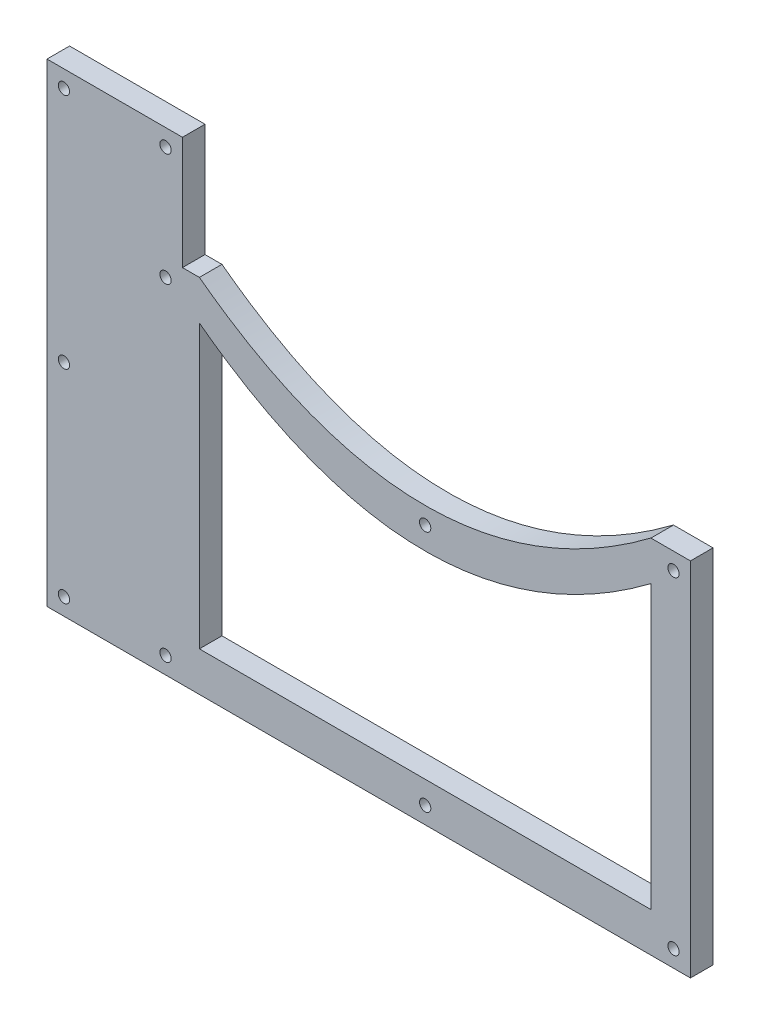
ISO-10303-21;
HEADER;
FILE_DESCRIPTION(('STEP AP214'),'2;1');
FILE_NAME('part.step','',(''),(''),'','','');
FILE_SCHEMA(('AUTOMOTIVE_DESIGN { 1 0 10303 214 1 1 1 1 }'));
ENDSEC;
DATA;
#1=APPLICATION_CONTEXT('core data for automotive mechanical design processes');
#2=APPLICATION_PROTOCOL_DEFINITION('international standard','automotive_design',2000,#1);
#3=PRODUCT_CONTEXT('',#1,'mechanical');
#4=PRODUCT('Part','Part','',(#3));
#5=PRODUCT_RELATED_PRODUCT_CATEGORY('part','',(#4));
#6=PRODUCT_DEFINITION_FORMATION('','',#4);
#7=PRODUCT_DEFINITION_CONTEXT('part definition',#1,'design');
#8=PRODUCT_DEFINITION('design','',#6,#7);
#9=PRODUCT_DEFINITION_SHAPE('','',#8);
#10=(LENGTH_UNIT() NAMED_UNIT(*) SI_UNIT(.MILLI.,.METRE.));
#11=(NAMED_UNIT(*) PLANE_ANGLE_UNIT() SI_UNIT($,.RADIAN.));
#12=(NAMED_UNIT(*) SI_UNIT($,.STERADIAN.) SOLID_ANGLE_UNIT());
#13=UNCERTAINTY_MEASURE_WITH_UNIT(LENGTH_MEASURE(1.E-05),#10,'distance_accuracy_value','');
#14=(GEOMETRIC_REPRESENTATION_CONTEXT(3) GLOBAL_UNCERTAINTY_ASSIGNED_CONTEXT((#13)) GLOBAL_UNIT_ASSIGNED_CONTEXT((#10,
#11,#12)) REPRESENTATION_CONTEXT('',''));
#15=CARTESIAN_POINT('',(0.,0.,0.));
#16=DIRECTION('',(0.,0.,1.));
#17=DIRECTION('',(1.,0.,0.));
#18=AXIS2_PLACEMENT_3D('',#15,#16,#17);
#19=CARTESIAN_POINT('',(67.,49.,4.));
#20=DIRECTION('',(0.,0.,-1.));
#21=DIRECTION('',(-1.,0.,0.));
#22=AXIS2_PLACEMENT_3D('',#19,#20,#21);
#23=PLANE('',#22);
#24=CARTESIAN_POINT('',(107.,64.,4.));
#25=CARTESIAN_POINT('',(67.,34.,4.));
#26=CARTESIAN_POINT('',(27.,64.,4.));
#27=B_SPLINE_CURVE_WITH_KNOTS('',2,(#24,#25,#26),.UNSPECIFIED.,.F.,.F.,(3,3),(0.,1.),.UNSPECIFIED.);
#28=CARTESIAN_POINT('',(107.,64.,4.));
#29=VERTEX_POINT('',#28);
#30=CARTESIAN_POINT('',(27.,64.,4.));
#31=VERTEX_POINT('',#30);
#32=EDGE_CURVE('E256',#29,#31,#27,.T.);
#33=ORIENTED_EDGE('',*,*,#32,.T.);
#34=DIRECTION('',(-1.,0.,0.));
#35=VECTOR('',#34,1.);
#36=CARTESIAN_POINT('',(24.,64.,4.));
#37=LINE('',#36,#35);
#38=CARTESIAN_POINT('',(24.,64.,4.));
#39=VERTEX_POINT('',#38);
#40=EDGE_CURVE('E290',#31,#39,#37,.T.);
#41=ORIENTED_EDGE('',*,*,#40,.T.);
#42=DIRECTION('',(0.,1.,0.));
#43=VECTOR('',#42,1.);
#44=CARTESIAN_POINT('',(24.,64.,4.));
#45=LINE('',#44,#43);
#46=CARTESIAN_POINT('',(24.,84.,4.));
#47=VERTEX_POINT('',#46);
#48=EDGE_CURVE('E231',#39,#47,#45,.T.);
#49=ORIENTED_EDGE('',*,*,#48,.T.);
#50=DIRECTION('',(-1.,0.,0.));
#51=VECTOR('',#50,1.);
#52=CARTESIAN_POINT('',(24.,84.,4.));
#53=LINE('',#52,#51);
#54=CARTESIAN_POINT('',(0.,84.,4.));
#55=VERTEX_POINT('',#54);
#56=EDGE_CURVE('E281',#47,#55,#53,.T.);
#57=ORIENTED_EDGE('',*,*,#56,.T.);
#58=DIRECTION('',(0.,-1.,0.));
#59=VECTOR('',#58,1.);
#60=CARTESIAN_POINT('',(0.,84.,4.));
#61=LINE('',#60,#59);
#62=CARTESIAN_POINT('',(0.,0.,4.));
#63=VERTEX_POINT('',#62);
#64=EDGE_CURVE('E284',#55,#63,#61,.T.);
#65=ORIENTED_EDGE('',*,*,#64,.T.);
#66=DIRECTION('',(1.,0.,0.));
#67=VECTOR('',#66,1.);
#68=CARTESIAN_POINT('',(0.,0.,4.));
#69=LINE('',#68,#67);
#70=CARTESIAN_POINT('',(114.,0.,4.));
#71=VERTEX_POINT('',#70);
#72=EDGE_CURVE('E288',#63,#71,#69,.T.);
#73=ORIENTED_EDGE('',*,*,#72,.T.);
#74=DIRECTION('',(0.,1.,0.));
#75=VECTOR('',#74,1.);
#76=CARTESIAN_POINT('',(114.,0.,4.));
#77=LINE('',#76,#75);
#78=CARTESIAN_POINT('',(114.,64.,4.));
#79=VERTEX_POINT('',#78);
#80=EDGE_CURVE('E296',#71,#79,#77,.T.);
#81=ORIENTED_EDGE('',*,*,#80,.T.);
#82=DIRECTION('',(-1.,0.,0.));
#83=VECTOR('',#82,1.);
#84=CARTESIAN_POINT('',(114.,64.,4.));
#85=LINE('',#84,#83);
#86=EDGE_CURVE('E262',#79,#29,#85,.T.);
#87=ORIENTED_EDGE('',*,*,#86,.T.);
#88=EDGE_LOOP('',(#33,#41,#49,#57,#65,#73,#81,#87));
#89=FACE_BOUND('',#88,.T.);
#90=DIRECTION('',(1.,0.,0.));
#91=VECTOR('',#90,1.);
#92=CARTESIAN_POINT('',(27.,6.99999999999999,4.));
#93=LINE('',#92,#91);
#94=CARTESIAN_POINT('',(27.,6.99999999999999,4.));
#95=VERTEX_POINT('',#94);
#96=CARTESIAN_POINT('',(107.,7.,4.));
#97=VERTEX_POINT('',#96);
#98=EDGE_CURVE('E130',#95,#97,#93,.T.);
#99=ORIENTED_EDGE('',*,*,#98,.F.);
#100=DIRECTION('',(0.,-1.,0.));
#101=VECTOR('',#100,1.);
#102=CARTESIAN_POINT('',(27.,57.,4.));
#103=LINE('',#102,#101);
#104=CARTESIAN_POINT('',(27.,57.,4.));
#105=VERTEX_POINT('',#104);
#106=EDGE_CURVE('E157',#105,#95,#103,.T.);
#107=ORIENTED_EDGE('',*,*,#106,.F.);
#108=CARTESIAN_POINT('',(107.,57.,4.));
#109=CARTESIAN_POINT('',(67.,27.,4.));
#110=CARTESIAN_POINT('',(27.,57.,4.));
#111=B_SPLINE_CURVE_WITH_KNOTS('',2,(#108,#109,#110),.UNSPECIFIED.,.F.,.F.,(3,3),(0.,1.),.UNSPECIFIED.);
#112=CARTESIAN_POINT('',(107.,57.,4.));
#113=VERTEX_POINT('',#112);
#114=EDGE_CURVE('E153',#113,#105,#111,.T.);
#115=ORIENTED_EDGE('',*,*,#114,.F.);
#116=DIRECTION('',(0.,1.,0.));
#117=VECTOR('',#116,1.);
#118=CARTESIAN_POINT('',(107.,7.,4.));
#119=LINE('',#118,#117);
#120=EDGE_CURVE('E139',#97,#113,#119,.T.);
#121=ORIENTED_EDGE('',*,*,#120,.F.);
#122=EDGE_LOOP('',(#99,#107,#115,#121));
#123=FACE_BOUND('',#122,.T.);
#124=CARTESIAN_POINT('',(3.,81.,4.));
#125=DIRECTION('',(0.,0.,1.));
#126=DIRECTION('',(1.,0.,0.));
#127=AXIS2_PLACEMENT_3D('',#124,#125,#126);
#128=CIRCLE('',#127,1.);
#129=CARTESIAN_POINT('',(4.,81.,4.));
#130=VERTEX_POINT('',#129);
#131=EDGE_CURVE('E347',#130,#130,#128,.T.);
#132=ORIENTED_EDGE('',*,*,#131,.F.);
#133=EDGE_LOOP('',(#132));
#134=FACE_BOUND('',#133,.T.);
#135=CARTESIAN_POINT('',(21.,81.,4.));
#136=DIRECTION('',(0.,0.,1.));
#137=DIRECTION('',(1.,0.,0.));
#138=AXIS2_PLACEMENT_3D('',#135,#136,#137);
#139=CIRCLE('',#138,1.);
#140=CARTESIAN_POINT('',(22.,81.,4.));
#141=VERTEX_POINT('',#140);
#142=EDGE_CURVE('E356',#141,#141,#139,.T.);
#143=ORIENTED_EDGE('',*,*,#142,.F.);
#144=EDGE_LOOP('',(#143));
#145=FACE_BOUND('',#144,.T.);
#146=CARTESIAN_POINT('',(21.,61.,4.));
#147=DIRECTION('',(0.,0.,1.));
#148=DIRECTION('',(1.,0.,0.));
#149=AXIS2_PLACEMENT_3D('',#146,#147,#148);
#150=CIRCLE('',#149,1.);
#151=CARTESIAN_POINT('',(22.,61.,4.));
#152=VERTEX_POINT('',#151);
#153=EDGE_CURVE('E362',#152,#152,#150,.T.);
#154=ORIENTED_EDGE('',*,*,#153,.F.);
#155=EDGE_LOOP('',(#154));
#156=FACE_BOUND('',#155,.T.);
#157=CARTESIAN_POINT('',(3.00000000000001,39.,4.));
#158=DIRECTION('',(0.,0.,1.));
#159=DIRECTION('',(1.,0.,0.));
#160=AXIS2_PLACEMENT_3D('',#157,#158,#159);
#161=CIRCLE('',#160,1.);
#162=CARTESIAN_POINT('',(4.00000000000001,39.,4.));
#163=VERTEX_POINT('',#162);
#164=EDGE_CURVE('E370',#163,#163,#161,.T.);
#165=ORIENTED_EDGE('',*,*,#164,.F.);
#166=EDGE_LOOP('',(#165));
#167=FACE_BOUND('',#166,.T.);
#168=CARTESIAN_POINT('',(3.00000000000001,3.,4.));
#169=DIRECTION('',(0.,0.,1.));
#170=DIRECTION('',(1.,0.,0.));
#171=AXIS2_PLACEMENT_3D('',#168,#169,#170);
#172=CIRCLE('',#171,1.);
#173=CARTESIAN_POINT('',(4.00000000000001,3.,4.));
#174=VERTEX_POINT('',#173);
#175=EDGE_CURVE('E378',#174,#174,#172,.T.);
#176=ORIENTED_EDGE('',*,*,#175,.F.);
#177=EDGE_LOOP('',(#176));
#178=FACE_BOUND('',#177,.T.);
#179=CARTESIAN_POINT('',(21.,3.,4.));
#180=DIRECTION('',(0.,0.,1.));
#181=DIRECTION('',(1.,0.,0.));
#182=AXIS2_PLACEMENT_3D('',#179,#180,#181);
#183=CIRCLE('',#182,1.);
#184=CARTESIAN_POINT('',(22.,3.,4.));
#185=VERTEX_POINT('',#184);
#186=EDGE_CURVE('E386',#185,#185,#183,.T.);
#187=ORIENTED_EDGE('',*,*,#186,.F.);
#188=EDGE_LOOP('',(#187));
#189=FACE_BOUND('',#188,.T.);
#190=CARTESIAN_POINT('',(67.,3.,4.));
#191=DIRECTION('',(0.,0.,1.));
#192=DIRECTION('',(1.,0.,0.));
#193=AXIS2_PLACEMENT_3D('',#190,#191,#192);
#194=CIRCLE('',#193,0.999999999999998);
#195=CARTESIAN_POINT('',(68.,3.,4.));
#196=VERTEX_POINT('',#195);
#197=EDGE_CURVE('E394',#196,#196,#194,.T.);
#198=ORIENTED_EDGE('',*,*,#197,.F.);
#199=EDGE_LOOP('',(#198));
#200=FACE_BOUND('',#199,.T.);
#201=CARTESIAN_POINT('',(111.,3.,4.));
#202=DIRECTION('',(0.,0.,1.));
#203=DIRECTION('',(1.,0.,0.));
#204=AXIS2_PLACEMENT_3D('',#201,#202,#203);
#205=CIRCLE('',#204,0.999999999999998);
#206=CARTESIAN_POINT('',(112.,3.,4.));
#207=VERTEX_POINT('',#206);
#208=EDGE_CURVE('E402',#207,#207,#205,.T.);
#209=ORIENTED_EDGE('',*,*,#208,.F.);
#210=EDGE_LOOP('',(#209));
#211=FACE_BOUND('',#210,.T.);
#212=CARTESIAN_POINT('',(111.,61.,4.));
#213=DIRECTION('',(0.,0.,1.));
#214=DIRECTION('',(1.,0.,0.));
#215=AXIS2_PLACEMENT_3D('',#212,#213,#214);
#216=CIRCLE('',#215,0.999999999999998);
#217=CARTESIAN_POINT('',(112.,61.,4.));
#218=VERTEX_POINT('',#217);
#219=EDGE_CURVE('E410',#218,#218,#216,.T.);
#220=ORIENTED_EDGE('',*,*,#219,.F.);
#221=EDGE_LOOP('',(#220));
#222=FACE_BOUND('',#221,.T.);
#223=CARTESIAN_POINT('',(67.,46.,4.));
#224=DIRECTION('',(0.,0.,1.));
#225=DIRECTION('',(1.,0.,0.));
#226=AXIS2_PLACEMENT_3D('',#223,#224,#225);
#227=CIRCLE('',#226,0.999999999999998);
#228=CARTESIAN_POINT('',(68.,46.,4.));
#229=VERTEX_POINT('',#228);
#230=EDGE_CURVE('E418',#229,#229,#227,.T.);
#231=ORIENTED_EDGE('',*,*,#230,.F.);
#232=EDGE_LOOP('',(#231));
#233=FACE_BOUND('',#232,.T.);
#234=ADVANCED_FACE('F39',(#89,#123,#134,#145,#156,#167,#178,#189,#200,#211,#222,#233),#23,.F.);
#235=CARTESIAN_POINT('',(67.,49.,0.));
#236=DIRECTION('',(0.,0.,-1.));
#237=DIRECTION('',(-1.,0.,0.));
#238=AXIS2_PLACEMENT_3D('',#235,#236,#237);
#239=PLANE('',#238);
#240=CARTESIAN_POINT('',(111.,61.,0.));
#241=DIRECTION('',(0.,0.,1.));
#242=DIRECTION('',(1.,0.,0.));
#243=AXIS2_PLACEMENT_3D('',#240,#241,#242);
#244=CIRCLE('',#243,0.999999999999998);
#245=CARTESIAN_POINT('',(112.,61.,0.));
#246=VERTEX_POINT('',#245);
#247=EDGE_CURVE('E414',#246,#246,#244,.T.);
#248=ORIENTED_EDGE('',*,*,#247,.T.);
#249=EDGE_LOOP('',(#248));
#250=FACE_BOUND('',#249,.T.);
#251=CARTESIAN_POINT('',(67.,3.,0.));
#252=DIRECTION('',(0.,0.,1.));
#253=DIRECTION('',(1.,0.,0.));
#254=AXIS2_PLACEMENT_3D('',#251,#252,#253);
#255=CIRCLE('',#254,0.999999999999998);
#256=CARTESIAN_POINT('',(68.,3.,0.));
#257=VERTEX_POINT('',#256);
#258=EDGE_CURVE('E398',#257,#257,#255,.T.);
#259=ORIENTED_EDGE('',*,*,#258,.T.);
#260=EDGE_LOOP('',(#259));
#261=FACE_BOUND('',#260,.T.);
#262=CARTESIAN_POINT('',(3.00000000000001,3.,0.));
#263=DIRECTION('',(0.,0.,1.));
#264=DIRECTION('',(1.,0.,0.));
#265=AXIS2_PLACEMENT_3D('',#262,#263,#264);
#266=CIRCLE('',#265,1.);
#267=CARTESIAN_POINT('',(4.00000000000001,3.,0.));
#268=VERTEX_POINT('',#267);
#269=EDGE_CURVE('E382',#268,#268,#266,.T.);
#270=ORIENTED_EDGE('',*,*,#269,.T.);
#271=EDGE_LOOP('',(#270));
#272=FACE_BOUND('',#271,.T.);
#273=CARTESIAN_POINT('',(21.,61.,0.));
#274=DIRECTION('',(0.,0.,1.));
#275=DIRECTION('',(1.,0.,0.));
#276=AXIS2_PLACEMENT_3D('',#273,#274,#275);
#277=CIRCLE('',#276,1.);
#278=CARTESIAN_POINT('',(22.,61.,0.));
#279=VERTEX_POINT('',#278);
#280=EDGE_CURVE('E366',#279,#279,#277,.T.);
#281=ORIENTED_EDGE('',*,*,#280,.T.);
#282=EDGE_LOOP('',(#281));
#283=FACE_BOUND('',#282,.T.);
#284=CARTESIAN_POINT('',(3.,81.,0.));
#285=DIRECTION('',(0.,0.,1.));
#286=DIRECTION('',(1.,0.,0.));
#287=AXIS2_PLACEMENT_3D('',#284,#285,#286);
#288=CIRCLE('',#287,1.);
#289=CARTESIAN_POINT('',(4.,81.,0.));
#290=VERTEX_POINT('',#289);
#291=EDGE_CURVE('E350',#290,#290,#288,.T.);
#292=ORIENTED_EDGE('',*,*,#291,.T.);
#293=EDGE_LOOP('',(#292));
#294=FACE_BOUND('',#293,.T.);
#295=CARTESIAN_POINT('',(107.,64.,0.));
#296=CARTESIAN_POINT('',(67.,34.,0.));
#297=CARTESIAN_POINT('',(27.,64.,0.));
#298=B_SPLINE_CURVE_WITH_KNOTS('',2,(#295,#296,#297),.UNSPECIFIED.,.F.,.F.,(3,3),(0.,1.),.UNSPECIFIED.);
#299=CARTESIAN_POINT('',(107.,64.,0.));
#300=VERTEX_POINT('',#299);
#301=CARTESIAN_POINT('',(27.,64.,0.));
#302=VERTEX_POINT('',#301);
#303=EDGE_CURVE('E148',#300,#302,#298,.T.);
#304=ORIENTED_EDGE('',*,*,#303,.F.);
#305=DIRECTION('',(-1.,0.,0.));
#306=VECTOR('',#305,1.);
#307=CARTESIAN_POINT('',(114.,64.,0.));
#308=LINE('',#307,#306);
#309=CARTESIAN_POINT('',(114.,64.,0.));
#310=VERTEX_POINT('',#309);
#311=EDGE_CURVE('E253',#310,#300,#308,.T.);
#312=ORIENTED_EDGE('',*,*,#311,.F.);
#313=DIRECTION('',(0.,1.,0.));
#314=VECTOR('',#313,1.);
#315=CARTESIAN_POINT('',(114.,0.,0.));
#316=LINE('',#315,#314);
#317=CARTESIAN_POINT('',(114.,0.,0.));
#318=VERTEX_POINT('',#317);
#319=EDGE_CURVE('E250',#318,#310,#316,.T.);
#320=ORIENTED_EDGE('',*,*,#319,.F.);
#321=DIRECTION('',(1.,0.,0.));
#322=VECTOR('',#321,1.);
#323=CARTESIAN_POINT('',(0.,0.,0.));
#324=LINE('',#323,#322);
#325=CARTESIAN_POINT('',(0.,0.,0.));
#326=VERTEX_POINT('',#325);
#327=EDGE_CURVE('E247',#326,#318,#324,.T.);
#328=ORIENTED_EDGE('',*,*,#327,.F.);
#329=DIRECTION('',(0.,-1.,0.));
#330=VECTOR('',#329,1.);
#331=CARTESIAN_POINT('',(0.,84.,0.));
#332=LINE('',#331,#330);
#333=CARTESIAN_POINT('',(0.,84.,0.));
#334=VERTEX_POINT('',#333);
#335=EDGE_CURVE('E241',#334,#326,#332,.T.);
#336=ORIENTED_EDGE('',*,*,#335,.F.);
#337=DIRECTION('',(-1.,0.,0.));
#338=VECTOR('',#337,1.);
#339=CARTESIAN_POINT('',(24.,84.,0.));
#340=LINE('',#339,#338);
#341=CARTESIAN_POINT('',(24.,84.,0.));
#342=VERTEX_POINT('',#341);
#343=EDGE_CURVE('E237',#342,#334,#340,.T.);
#344=ORIENTED_EDGE('',*,*,#343,.F.);
#345=DIRECTION('',(0.,1.,0.));
#346=VECTOR('',#345,1.);
#347=CARTESIAN_POINT('',(24.,64.,0.));
#348=LINE('',#347,#346);
#349=CARTESIAN_POINT('',(24.,64.,0.));
#350=VERTEX_POINT('',#349);
#351=EDGE_CURVE('E227',#350,#342,#348,.T.);
#352=ORIENTED_EDGE('',*,*,#351,.F.);
#353=DIRECTION('',(-1.,0.,0.));
#354=VECTOR('',#353,1.);
#355=CARTESIAN_POINT('',(24.,64.,0.));
#356=LINE('',#355,#354);
#357=EDGE_CURVE('E218',#302,#350,#356,.T.);
#358=ORIENTED_EDGE('',*,*,#357,.F.);
#359=EDGE_LOOP('',(#304,#312,#320,#328,#336,#344,#352,#358));
#360=FACE_BOUND('',#359,.T.);
#361=DIRECTION('',(0.,-1.,0.));
#362=VECTOR('',#361,1.);
#363=CARTESIAN_POINT('',(27.,57.,0.));
#364=LINE('',#363,#362);
#365=CARTESIAN_POINT('',(27.,57.,0.));
#366=VERTEX_POINT('',#365);
#367=CARTESIAN_POINT('',(27.,6.99999999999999,0.));
#368=VERTEX_POINT('',#367);
#369=EDGE_CURVE('E140',#366,#368,#364,.T.);
#370=ORIENTED_EDGE('',*,*,#369,.T.);
#371=DIRECTION('',(1.,0.,0.));
#372=VECTOR('',#371,1.);
#373=CARTESIAN_POINT('',(27.,6.99999999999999,0.));
#374=LINE('',#373,#372);
#375=CARTESIAN_POINT('',(107.,7.,0.));
#376=VERTEX_POINT('',#375);
#377=EDGE_CURVE('E64',#368,#376,#374,.T.);
#378=ORIENTED_EDGE('',*,*,#377,.T.);
#379=DIRECTION('',(0.,1.,0.));
#380=VECTOR('',#379,1.);
#381=CARTESIAN_POINT('',(107.,7.,0.));
#382=LINE('',#381,#380);
#383=CARTESIAN_POINT('',(107.,57.,0.));
#384=VERTEX_POINT('',#383);
#385=EDGE_CURVE('E146',#376,#384,#382,.T.);
#386=ORIENTED_EDGE('',*,*,#385,.T.);
#387=CARTESIAN_POINT('',(107.,57.,0.));
#388=CARTESIAN_POINT('',(67.,27.,0.));
#389=CARTESIAN_POINT('',(27.,57.,0.));
#390=B_SPLINE_CURVE_WITH_KNOTS('',2,(#387,#388,#389),.UNSPECIFIED.,.F.,.F.,(3,3),(0.,1.),.UNSPECIFIED.);
#391=EDGE_CURVE('E336',#384,#366,#390,.T.);
#392=ORIENTED_EDGE('',*,*,#391,.T.);
#393=EDGE_LOOP('',(#370,#378,#386,#392));
#394=FACE_BOUND('',#393,.T.);
#395=CARTESIAN_POINT('',(21.,81.,0.));
#396=DIRECTION('',(0.,0.,1.));
#397=DIRECTION('',(1.,0.,0.));
#398=AXIS2_PLACEMENT_3D('',#395,#396,#397);
#399=CIRCLE('',#398,1.);
#400=CARTESIAN_POINT('',(22.,81.,0.));
#401=VERTEX_POINT('',#400);
#402=EDGE_CURVE('E358',#401,#401,#399,.T.);
#403=ORIENTED_EDGE('',*,*,#402,.T.);
#404=EDGE_LOOP('',(#403));
#405=FACE_BOUND('',#404,.T.);
#406=CARTESIAN_POINT('',(3.00000000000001,39.,0.));
#407=DIRECTION('',(0.,0.,1.));
#408=DIRECTION('',(1.,0.,0.));
#409=AXIS2_PLACEMENT_3D('',#406,#407,#408);
#410=CIRCLE('',#409,1.);
#411=CARTESIAN_POINT('',(4.00000000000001,39.,0.));
#412=VERTEX_POINT('',#411);
#413=EDGE_CURVE('E374',#412,#412,#410,.T.);
#414=ORIENTED_EDGE('',*,*,#413,.T.);
#415=EDGE_LOOP('',(#414));
#416=FACE_BOUND('',#415,.T.);
#417=CARTESIAN_POINT('',(21.,3.,0.));
#418=DIRECTION('',(0.,0.,1.));
#419=DIRECTION('',(1.,0.,0.));
#420=AXIS2_PLACEMENT_3D('',#417,#418,#419);
#421=CIRCLE('',#420,1.);
#422=CARTESIAN_POINT('',(22.,3.,0.));
#423=VERTEX_POINT('',#422);
#424=EDGE_CURVE('E390',#423,#423,#421,.T.);
#425=ORIENTED_EDGE('',*,*,#424,.T.);
#426=EDGE_LOOP('',(#425));
#427=FACE_BOUND('',#426,.T.);
#428=CARTESIAN_POINT('',(111.,3.,0.));
#429=DIRECTION('',(0.,0.,1.));
#430=DIRECTION('',(1.,0.,0.));
#431=AXIS2_PLACEMENT_3D('',#428,#429,#430);
#432=CIRCLE('',#431,0.999999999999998);
#433=CARTESIAN_POINT('',(112.,3.,0.));
#434=VERTEX_POINT('',#433);
#435=EDGE_CURVE('E406',#434,#434,#432,.T.);
#436=ORIENTED_EDGE('',*,*,#435,.T.);
#437=EDGE_LOOP('',(#436));
#438=FACE_BOUND('',#437,.T.);
#439=CARTESIAN_POINT('',(67.,46.,0.));
#440=DIRECTION('',(0.,0.,1.));
#441=DIRECTION('',(1.,0.,0.));
#442=AXIS2_PLACEMENT_3D('',#439,#440,#441);
#443=CIRCLE('',#442,0.999999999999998);
#444=CARTESIAN_POINT('',(68.,46.,0.));
#445=VERTEX_POINT('',#444);
#446=EDGE_CURVE('E422',#445,#445,#443,.T.);
#447=ORIENTED_EDGE('',*,*,#446,.T.);
#448=EDGE_LOOP('',(#447));
#449=FACE_BOUND('',#448,.T.);
#450=ADVANCED_FACE('F183',(#250,#261,#272,#283,#294,#360,#394,#405,#416,#427,#438,#449),#239,.T.);
#451=DIRECTION('',(0.,0.,-1.));
#452=VECTOR('',#451,1.);
#453=SURFACE_OF_LINEAR_EXTRUSION('',#27,#452);
#454=ORIENTED_EDGE('',*,*,#303,.T.);
#455=DIRECTION('',(0.,0.,-1.));
#456=VECTOR('',#455,1.);
#457=CARTESIAN_POINT('',(27.,64.,4.));
#458=LINE('',#457,#456);
#459=EDGE_CURVE('E11',#31,#302,#458,.T.);
#460=ORIENTED_EDGE('',*,*,#459,.F.);
#461=ORIENTED_EDGE('',*,*,#32,.F.);
#462=DIRECTION('',(0.,0.,-1.));
#463=VECTOR('',#462,1.);
#464=CARTESIAN_POINT('',(107.,64.,4.));
#465=LINE('',#464,#463);
#466=EDGE_CURVE('E257',#29,#300,#465,.T.);
#467=ORIENTED_EDGE('',*,*,#466,.T.);
#468=EDGE_LOOP('',(#454,#460,#461,#467));
#469=FACE_BOUND('',#468,.T.);
#470=ADVANCED_FACE('F41',(#469),#453,.F.);
#471=CARTESIAN_POINT('',(24.,64.,4.));
#472=DIRECTION('',(0.,-1.,0.));
#473=DIRECTION('',(1.,0.,0.));
#474=AXIS2_PLACEMENT_3D('',#471,#472,#473);
#475=PLANE('',#474);
#476=ORIENTED_EDGE('',*,*,#357,.T.);
#477=DIRECTION('',(0.,0.,-1.));
#478=VECTOR('',#477,1.);
#479=CARTESIAN_POINT('',(24.,64.,4.));
#480=LINE('',#479,#478);
#481=EDGE_CURVE('E49',#39,#350,#480,.T.);
#482=ORIENTED_EDGE('',*,*,#481,.F.);
#483=ORIENTED_EDGE('',*,*,#40,.F.);
#484=ORIENTED_EDGE('',*,*,#459,.T.);
#485=EDGE_LOOP('',(#476,#482,#483,#484));
#486=FACE_BOUND('',#485,.T.);
#487=ADVANCED_FACE('F209',(#486),#475,.F.);
#488=CARTESIAN_POINT('',(24.,64.,4.));
#489=DIRECTION('',(-1.,0.,0.));
#490=DIRECTION('',(0.,0.,1.));
#491=AXIS2_PLACEMENT_3D('',#488,#489,#490);
#492=PLANE('',#491);
#493=ORIENTED_EDGE('',*,*,#351,.T.);
#494=DIRECTION('',(0.,0.,-1.));
#495=VECTOR('',#494,1.);
#496=CARTESIAN_POINT('',(24.,84.,4.));
#497=LINE('',#496,#495);
#498=EDGE_CURVE('E233',#47,#342,#497,.T.);
#499=ORIENTED_EDGE('',*,*,#498,.F.);
#500=ORIENTED_EDGE('',*,*,#48,.F.);
#501=ORIENTED_EDGE('',*,*,#481,.T.);
#502=EDGE_LOOP('',(#493,#499,#500,#501));
#503=FACE_BOUND('',#502,.T.);
#504=ADVANCED_FACE('F206',(#503),#492,.F.);
#505=CARTESIAN_POINT('',(24.,84.,4.));
#506=DIRECTION('',(0.,-1.,0.));
#507=DIRECTION('',(0.,0.,-1.));
#508=AXIS2_PLACEMENT_3D('',#505,#506,#507);
#509=PLANE('',#508);
#510=ORIENTED_EDGE('',*,*,#343,.T.);
#511=DIRECTION('',(0.,0.,-1.));
#512=VECTOR('',#511,1.);
#513=CARTESIAN_POINT('',(0.,84.,4.));
#514=LINE('',#513,#512);
#515=EDGE_CURVE('E274',#55,#334,#514,.T.);
#516=ORIENTED_EDGE('',*,*,#515,.F.);
#517=ORIENTED_EDGE('',*,*,#56,.F.);
#518=ORIENTED_EDGE('',*,*,#498,.T.);
#519=EDGE_LOOP('',(#510,#516,#517,#518));
#520=FACE_BOUND('',#519,.T.);
#521=ADVANCED_FACE('F202',(#520),#509,.F.);
#522=CARTESIAN_POINT('',(0.,84.,4.));
#523=DIRECTION('',(1.,0.,0.));
#524=DIRECTION('',(0.,1.,0.));
#525=AXIS2_PLACEMENT_3D('',#522,#523,#524);
#526=PLANE('',#525);
#527=ORIENTED_EDGE('',*,*,#335,.T.);
#528=DIRECTION('',(0.,0.,-1.));
#529=VECTOR('',#528,1.);
#530=CARTESIAN_POINT('',(0.,0.,4.));
#531=LINE('',#530,#529);
#532=EDGE_CURVE('E270',#63,#326,#531,.T.);
#533=ORIENTED_EDGE('',*,*,#532,.F.);
#534=ORIENTED_EDGE('',*,*,#64,.F.);
#535=ORIENTED_EDGE('',*,*,#515,.T.);
#536=EDGE_LOOP('',(#527,#533,#534,#535));
#537=FACE_BOUND('',#536,.T.);
#538=ADVANCED_FACE('F198',(#537),#526,.F.);
#539=CARTESIAN_POINT('',(0.,0.,4.));
#540=DIRECTION('',(0.,1.,0.));
#541=DIRECTION('',(0.,0.,1.));
#542=AXIS2_PLACEMENT_3D('',#539,#540,#541);
#543=PLANE('',#542);
#544=ORIENTED_EDGE('',*,*,#327,.T.);
#545=DIRECTION('',(0.,0.,-1.));
#546=VECTOR('',#545,1.);
#547=CARTESIAN_POINT('',(114.,0.,4.));
#548=LINE('',#547,#546);
#549=EDGE_CURVE('E266',#71,#318,#548,.T.);
#550=ORIENTED_EDGE('',*,*,#549,.F.);
#551=ORIENTED_EDGE('',*,*,#72,.F.);
#552=ORIENTED_EDGE('',*,*,#532,.T.);
#553=EDGE_LOOP('',(#544,#550,#551,#552));
#554=FACE_BOUND('',#553,.T.);
#555=ADVANCED_FACE('F194',(#554),#543,.F.);
#556=CARTESIAN_POINT('',(114.,0.,4.));
#557=DIRECTION('',(-1.,0.,0.));
#558=DIRECTION('',(0.,0.,1.));
#559=AXIS2_PLACEMENT_3D('',#556,#557,#558);
#560=PLANE('',#559);
#561=ORIENTED_EDGE('',*,*,#319,.T.);
#562=DIRECTION('',(0.,0.,-1.));
#563=VECTOR('',#562,1.);
#564=CARTESIAN_POINT('',(114.,64.,4.));
#565=LINE('',#564,#563);
#566=EDGE_CURVE('E261',#79,#310,#565,.T.);
#567=ORIENTED_EDGE('',*,*,#566,.F.);
#568=ORIENTED_EDGE('',*,*,#80,.F.);
#569=ORIENTED_EDGE('',*,*,#549,.T.);
#570=EDGE_LOOP('',(#561,#567,#568,#569));
#571=FACE_BOUND('',#570,.T.);
#572=ADVANCED_FACE('F190',(#571),#560,.F.);
#573=CARTESIAN_POINT('',(114.,64.,4.));
#574=DIRECTION('',(0.,-1.,0.));
#575=DIRECTION('',(1.,0.,0.));
#576=AXIS2_PLACEMENT_3D('',#573,#574,#575);
#577=PLANE('',#576);
#578=ORIENTED_EDGE('',*,*,#311,.T.);
#579=ORIENTED_EDGE('',*,*,#466,.F.);
#580=ORIENTED_EDGE('',*,*,#86,.F.);
#581=ORIENTED_EDGE('',*,*,#566,.T.);
#582=EDGE_LOOP('',(#578,#579,#580,#581));
#583=FACE_BOUND('',#582,.T.);
#584=ADVANCED_FACE('F180',(#583),#577,.F.);
#585=CARTESIAN_POINT('',(27.,6.99999999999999,4.));
#586=DIRECTION('',(0.,1.,0.));
#587=DIRECTION('',(-1.,0.,0.));
#588=AXIS2_PLACEMENT_3D('',#585,#586,#587);
#589=PLANE('',#588);
#590=ORIENTED_EDGE('',*,*,#377,.F.);
#591=DIRECTION('',(0.,0.,-1.));
#592=VECTOR('',#591,1.);
#593=CARTESIAN_POINT('',(27.,6.99999999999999,4.));
#594=LINE('',#593,#592);
#595=EDGE_CURVE('E134',#95,#368,#594,.T.);
#596=ORIENTED_EDGE('',*,*,#595,.F.);
#597=ORIENTED_EDGE('',*,*,#98,.T.);
#598=DIRECTION('',(0.,0.,-1.));
#599=VECTOR('',#598,1.);
#600=CARTESIAN_POINT('',(107.,7.,4.));
#601=LINE('',#600,#599);
#602=EDGE_CURVE('E133',#97,#376,#601,.T.);
#603=ORIENTED_EDGE('',*,*,#602,.T.);
#604=EDGE_LOOP('',(#590,#596,#597,#603));
#605=FACE_BOUND('',#604,.T.);
#606=ADVANCED_FACE('F132',(#605),#589,.T.);
#607=CARTESIAN_POINT('',(107.,7.,4.));
#608=DIRECTION('',(-1.,0.,0.));
#609=DIRECTION('',(0.,0.,1.));
#610=AXIS2_PLACEMENT_3D('',#607,#608,#609);
#611=PLANE('',#610);
#612=ORIENTED_EDGE('',*,*,#385,.F.);
#613=ORIENTED_EDGE('',*,*,#602,.F.);
#614=ORIENTED_EDGE('',*,*,#120,.T.);
#615=DIRECTION('',(0.,0.,-1.));
#616=VECTOR('',#615,1.);
#617=CARTESIAN_POINT('',(107.,57.,4.));
#618=LINE('',#617,#616);
#619=EDGE_CURVE('E149',#113,#384,#618,.T.);
#620=ORIENTED_EDGE('',*,*,#619,.T.);
#621=EDGE_LOOP('',(#612,#613,#614,#620));
#622=FACE_BOUND('',#621,.T.);
#623=ADVANCED_FACE('F143',(#622),#611,.T.);
#624=DIRECTION('',(0.,0.,-1.));
#625=VECTOR('',#624,1.);
#626=SURFACE_OF_LINEAR_EXTRUSION('',#111,#625);
#627=ORIENTED_EDGE('',*,*,#391,.F.);
#628=ORIENTED_EDGE('',*,*,#619,.F.);
#629=ORIENTED_EDGE('',*,*,#114,.T.);
#630=DIRECTION('',(0.,0.,-1.));
#631=VECTOR('',#630,1.);
#632=CARTESIAN_POINT('',(27.,57.,4.));
#633=LINE('',#632,#631);
#634=EDGE_CURVE('E56',#105,#366,#633,.T.);
#635=ORIENTED_EDGE('',*,*,#634,.T.);
#636=EDGE_LOOP('',(#627,#628,#629,#635));
#637=FACE_BOUND('',#636,.T.);
#638=ADVANCED_FACE('F169',(#637),#626,.T.);
#639=CARTESIAN_POINT('',(27.,57.,4.));
#640=DIRECTION('',(1.,0.,0.));
#641=DIRECTION('',(0.,1.,0.));
#642=AXIS2_PLACEMENT_3D('',#639,#640,#641);
#643=PLANE('',#642);
#644=ORIENTED_EDGE('',*,*,#369,.F.);
#645=ORIENTED_EDGE('',*,*,#634,.F.);
#646=ORIENTED_EDGE('',*,*,#106,.T.);
#647=ORIENTED_EDGE('',*,*,#595,.T.);
#648=EDGE_LOOP('',(#644,#645,#646,#647));
#649=FACE_BOUND('',#648,.T.);
#650=ADVANCED_FACE('F173',(#649),#643,.T.);
#651=CARTESIAN_POINT('',(3.,81.,4.));
#652=DIRECTION('',(0.,0.,-1.));
#653=DIRECTION('',(-1.,0.,0.));
#654=AXIS2_PLACEMENT_3D('',#651,#652,#653);
#655=CYLINDRICAL_SURFACE('',#654,1.);
#656=ORIENTED_EDGE('',*,*,#131,.T.);
#657=EDGE_LOOP('',(#656));
#658=FACE_BOUND('',#657,.T.);
#659=ORIENTED_EDGE('',*,*,#291,.F.);
#660=EDGE_LOOP('',(#659));
#661=FACE_BOUND('',#660,.T.);
#662=ADVANCED_FACE('F470',(#658,#661),#655,.F.);
#663=CARTESIAN_POINT('',(21.,81.,4.));
#664=DIRECTION('',(0.,0.,-1.));
#665=DIRECTION('',(-1.,0.,0.));
#666=AXIS2_PLACEMENT_3D('',#663,#664,#665);
#667=CYLINDRICAL_SURFACE('',#666,1.);
#668=ORIENTED_EDGE('',*,*,#142,.T.);
#669=EDGE_LOOP('',(#668));
#670=FACE_BOUND('',#669,.T.);
#671=ORIENTED_EDGE('',*,*,#402,.F.);
#672=EDGE_LOOP('',(#671));
#673=FACE_BOUND('',#672,.T.);
#674=ADVANCED_FACE('F467',(#670,#673),#667,.F.);
#675=CARTESIAN_POINT('',(21.,61.,4.));
#676=DIRECTION('',(0.,0.,-1.));
#677=DIRECTION('',(-1.,0.,0.));
#678=AXIS2_PLACEMENT_3D('',#675,#676,#677);
#679=CYLINDRICAL_SURFACE('',#678,1.);
#680=ORIENTED_EDGE('',*,*,#153,.T.);
#681=EDGE_LOOP('',(#680));
#682=FACE_BOUND('',#681,.T.);
#683=ORIENTED_EDGE('',*,*,#280,.F.);
#684=EDGE_LOOP('',(#683));
#685=FACE_BOUND('',#684,.T.);
#686=ADVANCED_FACE('F463',(#682,#685),#679,.F.);
#687=CARTESIAN_POINT('',(3.00000000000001,39.,4.));
#688=DIRECTION('',(0.,0.,-1.));
#689=DIRECTION('',(-1.,0.,0.));
#690=AXIS2_PLACEMENT_3D('',#687,#688,#689);
#691=CYLINDRICAL_SURFACE('',#690,1.);
#692=ORIENTED_EDGE('',*,*,#164,.T.);
#693=EDGE_LOOP('',(#692));
#694=FACE_BOUND('',#693,.T.);
#695=ORIENTED_EDGE('',*,*,#413,.F.);
#696=EDGE_LOOP('',(#695));
#697=FACE_BOUND('',#696,.T.);
#698=ADVANCED_FACE('F459',(#694,#697),#691,.F.);
#699=CARTESIAN_POINT('',(3.00000000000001,3.,4.));
#700=DIRECTION('',(0.,0.,-1.));
#701=DIRECTION('',(-1.,0.,0.));
#702=AXIS2_PLACEMENT_3D('',#699,#700,#701);
#703=CYLINDRICAL_SURFACE('',#702,1.);
#704=ORIENTED_EDGE('',*,*,#175,.T.);
#705=EDGE_LOOP('',(#704));
#706=FACE_BOUND('',#705,.T.);
#707=ORIENTED_EDGE('',*,*,#269,.F.);
#708=EDGE_LOOP('',(#707));
#709=FACE_BOUND('',#708,.T.);
#710=ADVANCED_FACE('F455',(#706,#709),#703,.F.);
#711=CARTESIAN_POINT('',(21.,3.,4.));
#712=DIRECTION('',(0.,0.,-1.));
#713=DIRECTION('',(-1.,0.,0.));
#714=AXIS2_PLACEMENT_3D('',#711,#712,#713);
#715=CYLINDRICAL_SURFACE('',#714,1.);
#716=ORIENTED_EDGE('',*,*,#186,.T.);
#717=EDGE_LOOP('',(#716));
#718=FACE_BOUND('',#717,.T.);
#719=ORIENTED_EDGE('',*,*,#424,.F.);
#720=EDGE_LOOP('',(#719));
#721=FACE_BOUND('',#720,.T.);
#722=ADVANCED_FACE('F451',(#718,#721),#715,.F.);
#723=CARTESIAN_POINT('',(67.,3.,4.));
#724=DIRECTION('',(0.,0.,-1.));
#725=DIRECTION('',(-1.,0.,0.));
#726=AXIS2_PLACEMENT_3D('',#723,#724,#725);
#727=CYLINDRICAL_SURFACE('',#726,0.999999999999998);
#728=ORIENTED_EDGE('',*,*,#197,.T.);
#729=EDGE_LOOP('',(#728));
#730=FACE_BOUND('',#729,.T.);
#731=ORIENTED_EDGE('',*,*,#258,.F.);
#732=EDGE_LOOP('',(#731));
#733=FACE_BOUND('',#732,.T.);
#734=ADVANCED_FACE('F447',(#730,#733),#727,.F.);
#735=CARTESIAN_POINT('',(111.,3.,4.));
#736=DIRECTION('',(0.,0.,-1.));
#737=DIRECTION('',(-1.,0.,0.));
#738=AXIS2_PLACEMENT_3D('',#735,#736,#737);
#739=CYLINDRICAL_SURFACE('',#738,0.999999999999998);
#740=ORIENTED_EDGE('',*,*,#208,.T.);
#741=EDGE_LOOP('',(#740));
#742=FACE_BOUND('',#741,.T.);
#743=ORIENTED_EDGE('',*,*,#435,.F.);
#744=EDGE_LOOP('',(#743));
#745=FACE_BOUND('',#744,.T.);
#746=ADVANCED_FACE('F441',(#742,#745),#739,.F.);
#747=CARTESIAN_POINT('',(111.,61.,4.));
#748=DIRECTION('',(0.,0.,-1.));
#749=DIRECTION('',(-1.,0.,0.));
#750=AXIS2_PLACEMENT_3D('',#747,#748,#749);
#751=CYLINDRICAL_SURFACE('',#750,0.999999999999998);
#752=ORIENTED_EDGE('',*,*,#219,.T.);
#753=EDGE_LOOP('',(#752));
#754=FACE_BOUND('',#753,.T.);
#755=ORIENTED_EDGE('',*,*,#247,.F.);
#756=EDGE_LOOP('',(#755));
#757=FACE_BOUND('',#756,.T.);
#758=ADVANCED_FACE('F434',(#754,#757),#751,.F.);
#759=CARTESIAN_POINT('',(67.,46.,4.));
#760=DIRECTION('',(0.,0.,-1.));
#761=DIRECTION('',(-1.,0.,0.));
#762=AXIS2_PLACEMENT_3D('',#759,#760,#761);
#763=CYLINDRICAL_SURFACE('',#762,0.999999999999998);
#764=ORIENTED_EDGE('',*,*,#230,.T.);
#765=EDGE_LOOP('',(#764));
#766=FACE_BOUND('',#765,.T.);
#767=ORIENTED_EDGE('',*,*,#446,.F.);
#768=EDGE_LOOP('',(#767));
#769=FACE_BOUND('',#768,.T.);
#770=ADVANCED_FACE('F430',(#766,#769),#763,.F.);
#771=CLOSED_SHELL('',(#234,#450,#470,#487,#504,#521,#538,#555,#572,#584,#606,#623,#638,#650,
#662,#674,#686,#698,#710,#722,#734,#746,#758,#770));
#772=MANIFOLD_SOLID_BREP('B2',#771);
#773=ADVANCED_BREP_SHAPE_REPRESENTATION('',(#18,#772),#14);
#774=SHAPE_DEFINITION_REPRESENTATION(#9,#773);
ENDSEC;
END-ISO-10303-21;
